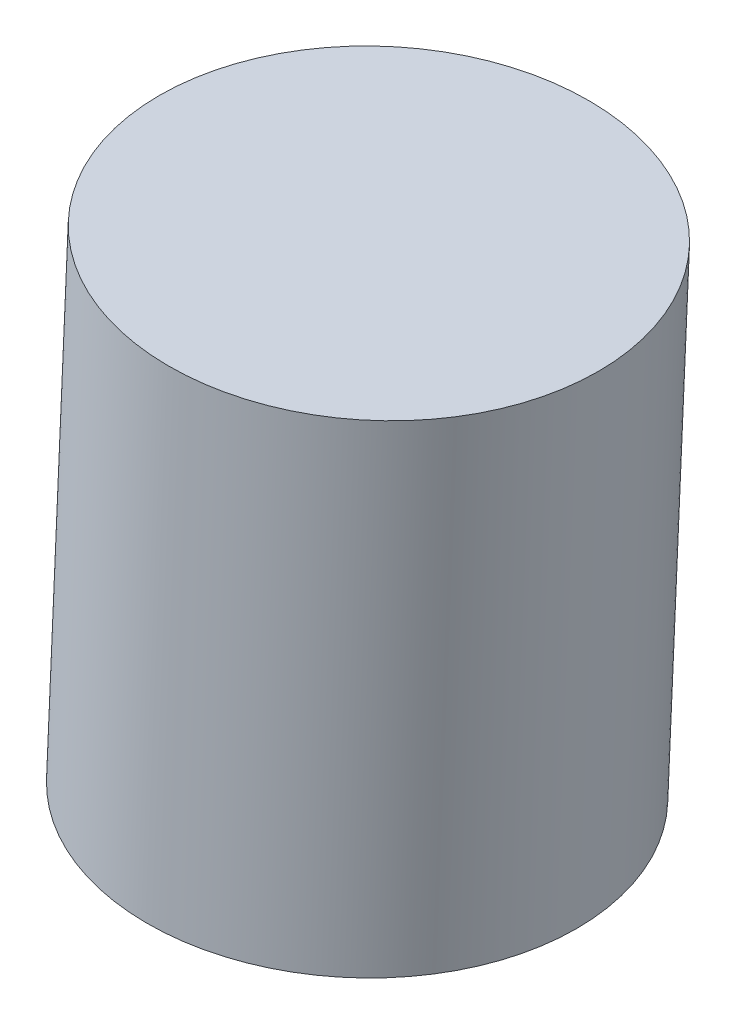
ISO-10303-21;
HEADER;
FILE_DESCRIPTION(('STEP AP214'),'2;1');
FILE_NAME('part.step','',(''),(''),'','','');
FILE_SCHEMA(('AUTOMOTIVE_DESIGN { 1 0 10303 214 1 1 1 1 }'));
ENDSEC;
DATA;
#1=APPLICATION_CONTEXT('core data for automotive mechanical design processes');
#2=APPLICATION_PROTOCOL_DEFINITION('international standard','automotive_design',2000,#1);
#3=PRODUCT_CONTEXT('',#1,'mechanical');
#4=PRODUCT('Part','Part','',(#3));
#5=PRODUCT_RELATED_PRODUCT_CATEGORY('part','',(#4));
#6=PRODUCT_DEFINITION_FORMATION('','',#4);
#7=PRODUCT_DEFINITION_CONTEXT('part definition',#1,'design');
#8=PRODUCT_DEFINITION('design','',#6,#7);
#9=PRODUCT_DEFINITION_SHAPE('','',#8);
#10=(LENGTH_UNIT() NAMED_UNIT(*) SI_UNIT(.MILLI.,.METRE.));
#11=(NAMED_UNIT(*) PLANE_ANGLE_UNIT() SI_UNIT($,.RADIAN.));
#12=(NAMED_UNIT(*) SI_UNIT($,.STERADIAN.) SOLID_ANGLE_UNIT());
#13=UNCERTAINTY_MEASURE_WITH_UNIT(LENGTH_MEASURE(1.E-05),#10,'distance_accuracy_value','');
#14=(GEOMETRIC_REPRESENTATION_CONTEXT(3) GLOBAL_UNCERTAINTY_ASSIGNED_CONTEXT((#13)) GLOBAL_UNIT_ASSIGNED_CONTEXT((#10,
#11,#12)) REPRESENTATION_CONTEXT('',''));
#15=CARTESIAN_POINT('',(0.,0.,0.));
#16=DIRECTION('',(0.,0.,1.));
#17=DIRECTION('',(1.,0.,0.));
#18=AXIS2_PLACEMENT_3D('',#15,#16,#17);
#19=CARTESIAN_POINT('',(-46.8725463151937,-4.55928526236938,-31.8));
#20=DIRECTION('',(0.0440198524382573,0.999030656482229,0.));
#21=DIRECTION('',(-0.999030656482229,0.0440198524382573,0.));
#22=AXIS2_PLACEMENT_3D('',#19,#20,#21);
#23=PLANE('',#22);
#24=CARTESIAN_POINT('',(-46.8725463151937,-4.55928526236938,-31.8));
#25=DIRECTION('',(0.0440198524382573,0.999030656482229,0.));
#26=DIRECTION('',(-0.999030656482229,0.0440198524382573,0.));
#27=AXIS2_PLACEMENT_3D('',#24,#25,#26);
#28=CIRCLE('',#27,2.225);
#29=CARTESIAN_POINT('',(-49.0953895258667,-4.46134109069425,-31.8));
#30=VERTEX_POINT('',#29);
#31=EDGE_CURVE('E18',#30,#30,#28,.T.);
#32=ORIENTED_EDGE('',*,*,#31,.F.);
#33=EDGE_LOOP('',(#32));
#34=FACE_BOUND('',#33,.T.);
#35=ADVANCED_FACE('F15',(#34),#23,.F.);
#36=CARTESIAN_POINT('',(-46.6524470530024,0.435868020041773,-31.8));
#37=DIRECTION('',(0.0440198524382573,0.999030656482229,0.));
#38=DIRECTION('',(-0.999030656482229,0.0440198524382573,0.));
#39=AXIS2_PLACEMENT_3D('',#36,#37,#38);
#40=PLANE('',#39);
#41=CARTESIAN_POINT('',(-46.6524470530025,0.435868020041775,-31.8));
#42=DIRECTION('',(0.0440198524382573,0.999030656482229,0.));
#43=DIRECTION('',(-0.999030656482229,0.0440198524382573,0.));
#44=AXIS2_PLACEMENT_3D('',#41,#42,#43);
#45=CIRCLE('',#44,2.225);
#46=CARTESIAN_POINT('',(-48.8752902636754,0.533812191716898,-31.8));
#47=VERTEX_POINT('',#46);
#48=EDGE_CURVE('E10',#47,#47,#45,.F.);
#49=ORIENTED_EDGE('',*,*,#48,.F.);
#50=EDGE_LOOP('',(#49));
#51=FACE_BOUND('',#50,.T.);
#52=ADVANCED_FACE('F30',(#51),#40,.T.);
#53=CARTESIAN_POINT('',(-46.7624966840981,-2.0617086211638,-31.8));
#54=DIRECTION('',(0.0440198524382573,0.999030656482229,0.));
#55=DIRECTION('',(-0.999030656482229,0.0440198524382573,0.));
#56=AXIS2_PLACEMENT_3D('',#53,#54,#55);
#57=CYLINDRICAL_SURFACE('',#56,2.225);
#58=ORIENTED_EDGE('',*,*,#31,.T.);
#59=EDGE_LOOP('',(#58));
#60=FACE_BOUND('',#59,.T.);
#61=ORIENTED_EDGE('',*,*,#48,.T.);
#62=EDGE_LOOP('',(#61));
#63=FACE_BOUND('',#62,.T.);
#64=ADVANCED_FACE('F27',(#60,#63),#57,.T.);
#65=CLOSED_SHELL('',(#35,#52,#64));
#66=MANIFOLD_SOLID_BREP('B1',#65);
#67=ADVANCED_BREP_SHAPE_REPRESENTATION('',(#18,#66),#14);
#68=SHAPE_DEFINITION_REPRESENTATION(#9,#67);
ENDSEC;
END-ISO-10303-21;
